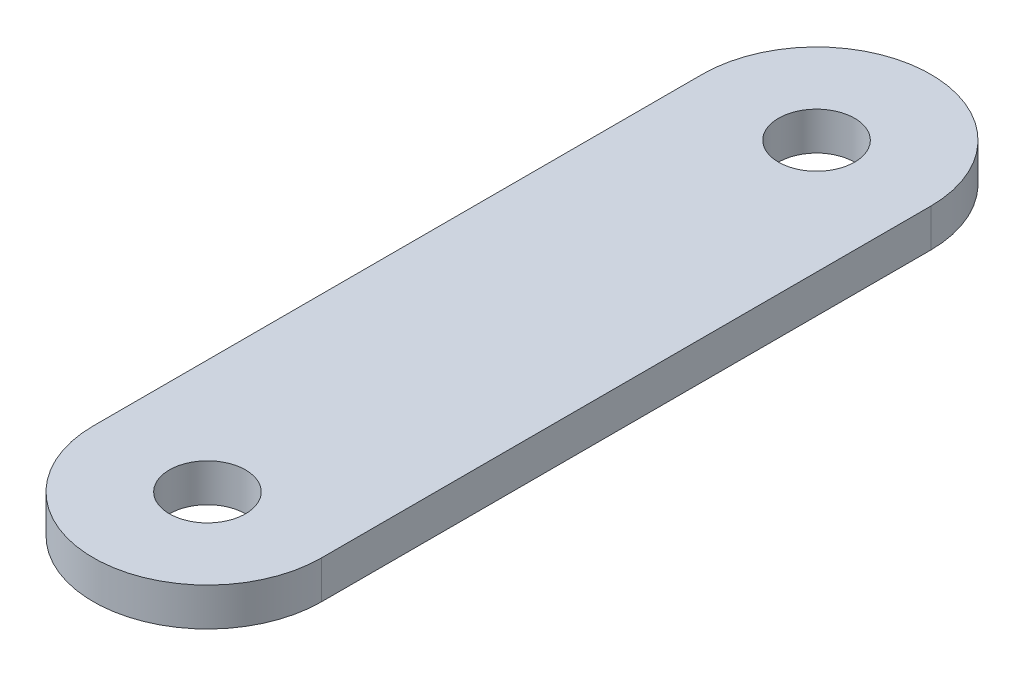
from build123d import *

# Parameters (mm, degrees)
SKETCH1_R           = 1
BOSS_EXTRUDE1_DEPTH = 1


with BuildPart() as part:
    # Sketch1 → Boss-Extrude1 (new body)
    with BuildSketch(Plane(origin=(0, 0, 0), x_dir=(1, 0, 0), z_dir=(0, 1, 0))):
        with BuildLine():
            Line((-3, 8), (-3, 0))
            Line((-3, 0), (3, 0))
            Line((3, 0), (3, 8))
            ThreePointArc((3, 8), (0, 11), (-3, 8))
        make_face()
        with Locations(Location((0, 8, 0), (0, 0, 270))):
            Circle(SKETCH1_R, mode=Mode.SUBTRACT)
    extrude(amount=BOSS_EXTRUDE1_DEPTH)

    # Mirror1: part across plane


with BuildPart() as part_1:
    add(part.part)
    add(part.part.mirror(Plane(origin=(-3, 1, 0), x_dir=(1, 0, 0), z_dir=(0, 0, -1))))


solid = part_1.part
